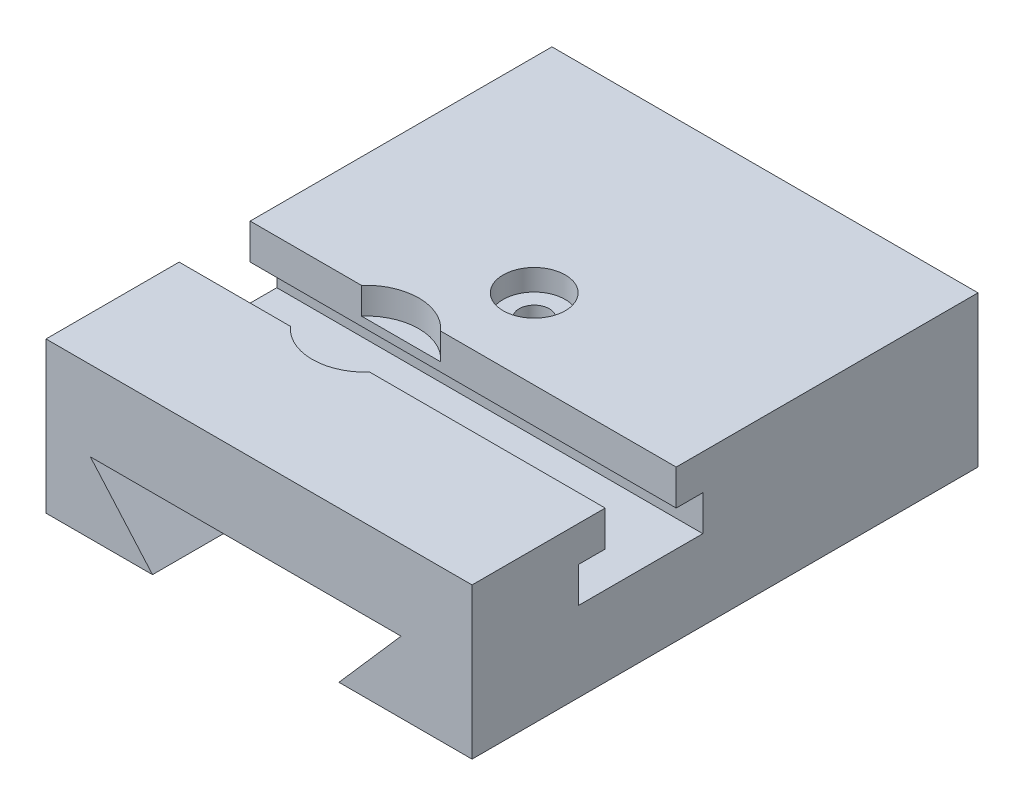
ISO-10303-21;
HEADER;
FILE_DESCRIPTION(('STEP AP214'),'2;1');
FILE_NAME('part.step','',(''),(''),'','','');
FILE_SCHEMA(('AUTOMOTIVE_DESIGN { 1 0 10303 214 1 1 1 1 }'));
ENDSEC;
DATA;
#1=APPLICATION_CONTEXT('core data for automotive mechanical design processes');
#2=APPLICATION_PROTOCOL_DEFINITION('international standard','automotive_design',2000,#1);
#3=PRODUCT_CONTEXT('',#1,'mechanical');
#4=PRODUCT('Part','Part','',(#3));
#5=PRODUCT_RELATED_PRODUCT_CATEGORY('part','',(#4));
#6=PRODUCT_DEFINITION_FORMATION('','',#4);
#7=PRODUCT_DEFINITION_CONTEXT('part definition',#1,'design');
#8=PRODUCT_DEFINITION('design','',#6,#7);
#9=PRODUCT_DEFINITION_SHAPE('','',#8);
#10=(LENGTH_UNIT() NAMED_UNIT(*) SI_UNIT(.MILLI.,.METRE.));
#11=(NAMED_UNIT(*) PLANE_ANGLE_UNIT() SI_UNIT($,.RADIAN.));
#12=(NAMED_UNIT(*) SI_UNIT($,.STERADIAN.) SOLID_ANGLE_UNIT());
#13=UNCERTAINTY_MEASURE_WITH_UNIT(LENGTH_MEASURE(1.E-05),#10,'distance_accuracy_value','');
#14=(GEOMETRIC_REPRESENTATION_CONTEXT(3) GLOBAL_UNCERTAINTY_ASSIGNED_CONTEXT((#13)) GLOBAL_UNIT_ASSIGNED_CONTEXT((#10,
#11,#12)) REPRESENTATION_CONTEXT('',''));
#15=CARTESIAN_POINT('',(0.,0.,0.));
#16=DIRECTION('',(0.,0.,1.));
#17=DIRECTION('',(1.,0.,0.));
#18=AXIS2_PLACEMENT_3D('',#15,#16,#17);
#19=CARTESIAN_POINT('',(0.,0.,0.));
#20=DIRECTION('',(0.,1.,0.));
#21=DIRECTION('',(0.,0.,1.));
#22=AXIS2_PLACEMENT_3D('',#19,#20,#21);
#23=PLANE('',#22);
#24=DIRECTION('',(-1.,0.,0.));
#25=VECTOR('',#24,1.);
#26=CARTESIAN_POINT('',(-24.,0.,-28.5));
#27=LINE('',#26,#25);
#28=CARTESIAN_POINT('',(-12.,0.,-28.5));
#29=VERTEX_POINT('',#28);
#30=CARTESIAN_POINT('',(-24.,0.,-28.5));
#31=VERTEX_POINT('',#30);
#32=EDGE_CURVE('E324',#29,#31,#27,.T.);
#33=ORIENTED_EDGE('',*,*,#32,.F.);
#34=DIRECTION('',(0.,0.,1.));
#35=VECTOR('',#34,1.);
#36=CARTESIAN_POINT('',(-12.,0.,-28.501));
#37=LINE('',#36,#35);
#38=CARTESIAN_POINT('',(-12.,0.,28.5));
#39=VERTEX_POINT('',#38);
#40=EDGE_CURVE('E245',#29,#39,#37,.T.);
#41=ORIENTED_EDGE('',*,*,#40,.T.);
#42=DIRECTION('',(1.,0.,0.));
#43=VECTOR('',#42,1.);
#44=CARTESIAN_POINT('',(-24.,0.,28.5));
#45=LINE('',#44,#43);
#46=CARTESIAN_POINT('',(-24.,0.,28.5));
#47=VERTEX_POINT('',#46);
#48=EDGE_CURVE('E201',#47,#39,#45,.T.);
#49=ORIENTED_EDGE('',*,*,#48,.F.);
#50=DIRECTION('',(0.,0.,1.));
#51=VECTOR('',#50,1.);
#52=CARTESIAN_POINT('',(-24.,0.,-28.5));
#53=LINE('',#52,#51);
#54=EDGE_CURVE('E202',#31,#47,#53,.T.);
#55=ORIENTED_EDGE('',*,*,#54,.F.);
#56=EDGE_LOOP('',(#33,#41,#49,#55));
#57=FACE_BOUND('',#56,.T.);
#58=ADVANCED_FACE('F39',(#57),#23,.F.);
#59=CARTESIAN_POINT('',(0.,17.,0.));
#60=DIRECTION('',(0.,1.,0.));
#61=DIRECTION('',(0.,0.,1.));
#62=AXIS2_PLACEMENT_3D('',#59,#60,#61);
#63=PLANE('',#62);
#64=CARTESIAN_POINT('',(-1.,17.,-3.5));
#65=DIRECTION('',(0.,1.,0.));
#66=DIRECTION('',(0.,0.,1.));
#67=AXIS2_PLACEMENT_3D('',#64,#65,#66);
#68=CIRCLE('',#67,3.5);
#69=CARTESIAN_POINT('',(-1.,17.,0.));
#70=VERTEX_POINT('',#69);
#71=EDGE_CURVE('E643',#70,#70,#68,.T.);
#72=ORIENTED_EDGE('',*,*,#71,.F.);
#73=EDGE_LOOP('',(#72));
#74=FACE_BOUND('',#73,.T.);
#75=CARTESIAN_POINT('',(-7.,17.,9.5));
#76=DIRECTION('',(0.,1.,0.));
#77=DIRECTION('',(0.,0.,1.));
#78=AXIS2_PLACEMENT_3D('',#75,#76,#77);
#79=CIRCLE('',#78,6.);
#80=CARTESIAN_POINT('',(-2.52786404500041,17.,5.50000000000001));
#81=VERTEX_POINT('',#80);
#82=CARTESIAN_POINT('',(-11.4721359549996,17.,5.50000000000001));
#83=VERTEX_POINT('',#82);
#84=EDGE_CURVE('E243',#81,#83,#79,.T.);
#85=ORIENTED_EDGE('',*,*,#84,.F.);
#86=DIRECTION('',(1.,0.,0.));
#87=VECTOR('',#86,1.);
#88=CARTESIAN_POINT('',(-24.001,17.,5.50000000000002));
#89=LINE('',#88,#87);
#90=CARTESIAN_POINT('',(24.,17.,5.5));
#91=VERTEX_POINT('',#90);
#92=EDGE_CURVE('E300',#81,#91,#89,.T.);
#93=ORIENTED_EDGE('',*,*,#92,.T.);
#94=DIRECTION('',(0.,0.,-1.));
#95=VECTOR('',#94,1.);
#96=CARTESIAN_POINT('',(24.,17.,-28.5));
#97=LINE('',#96,#95);
#98=CARTESIAN_POINT('',(24.,17.,-28.5));
#99=VERTEX_POINT('',#98);
#100=EDGE_CURVE('E204',#91,#99,#97,.T.);
#101=ORIENTED_EDGE('',*,*,#100,.T.);
#102=DIRECTION('',(-1.,0.,0.));
#103=VECTOR('',#102,1.);
#104=CARTESIAN_POINT('',(-24.,17.,-28.5));
#105=LINE('',#104,#103);
#106=CARTESIAN_POINT('',(-24.,17.,-28.5));
#107=VERTEX_POINT('',#106);
#108=EDGE_CURVE('E317',#99,#107,#105,.T.);
#109=ORIENTED_EDGE('',*,*,#108,.T.);
#110=DIRECTION('',(0.,0.,1.));
#111=VECTOR('',#110,1.);
#112=CARTESIAN_POINT('',(-24.,17.,-28.5));
#113=LINE('',#112,#111);
#114=CARTESIAN_POINT('',(-24.,17.,5.50000000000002));
#115=VERTEX_POINT('',#114);
#116=EDGE_CURVE('E320',#107,#115,#113,.T.);
#117=ORIENTED_EDGE('',*,*,#116,.T.);
#118=EDGE_CURVE('E296',#115,#83,#89,.T.);
#119=ORIENTED_EDGE('',*,*,#118,.T.);
#120=EDGE_LOOP('',(#85,#93,#101,#109,#117,#119));
#121=FACE_BOUND('',#120,.T.);
#122=ADVANCED_FACE('F374',(#74,#121),#63,.T.);
#123=CARTESIAN_POINT('',(24.,17.,-28.5));
#124=DIRECTION('',(-1.,0.,0.));
#125=DIRECTION('',(0.,0.,1.));
#126=AXIS2_PLACEMENT_3D('',#123,#124,#125);
#127=PLANE('',#126);
#128=ORIENTED_EDGE('',*,*,#100,.F.);
#129=DIRECTION('',(0.,1.,0.));
#130=VECTOR('',#129,1.);
#131=CARTESIAN_POINT('',(24.,13.,5.5));
#132=LINE('',#131,#130);
#133=CARTESIAN_POINT('',(24.,13.,5.5));
#134=VERTEX_POINT('',#133);
#135=EDGE_CURVE('E293',#134,#91,#132,.T.);
#136=ORIENTED_EDGE('',*,*,#135,.F.);
#137=DIRECTION('',(0.,0.,1.));
#138=VECTOR('',#137,1.);
#139=CARTESIAN_POINT('',(24.,13.,2.5));
#140=LINE('',#139,#138);
#141=CARTESIAN_POINT('',(24.,13.,2.5));
#142=VERTEX_POINT('',#141);
#143=EDGE_CURVE('E290',#142,#134,#140,.T.);
#144=ORIENTED_EDGE('',*,*,#143,.F.);
#145=DIRECTION('',(0.,1.,0.));
#146=VECTOR('',#145,1.);
#147=CARTESIAN_POINT('',(24.,9.,2.5));
#148=LINE('',#147,#146);
#149=CARTESIAN_POINT('',(24.,9.,2.5));
#150=VERTEX_POINT('',#149);
#151=EDGE_CURVE('E287',#150,#142,#148,.T.);
#152=ORIENTED_EDGE('',*,*,#151,.F.);
#153=DIRECTION('',(0.,0.,-1.));
#154=VECTOR('',#153,1.);
#155=CARTESIAN_POINT('',(24.,9.,16.5));
#156=LINE('',#155,#154);
#157=CARTESIAN_POINT('',(24.,9.,16.5));
#158=VERTEX_POINT('',#157);
#159=EDGE_CURVE('E284',#158,#150,#156,.T.);
#160=ORIENTED_EDGE('',*,*,#159,.F.);
#161=DIRECTION('',(0.,-1.,0.));
#162=VECTOR('',#161,1.);
#163=CARTESIAN_POINT('',(24.,13.,16.5));
#164=LINE('',#163,#162);
#165=CARTESIAN_POINT('',(24.,13.,16.5));
#166=VERTEX_POINT('',#165);
#167=EDGE_CURVE('E281',#166,#158,#164,.T.);
#168=ORIENTED_EDGE('',*,*,#167,.F.);
#169=DIRECTION('',(0.,0.,1.));
#170=VECTOR('',#169,1.);
#171=CARTESIAN_POINT('',(24.,13.,13.5));
#172=LINE('',#171,#170);
#173=CARTESIAN_POINT('',(24.,13.,13.5));
#174=VERTEX_POINT('',#173);
#175=EDGE_CURVE('E278',#174,#166,#172,.T.);
#176=ORIENTED_EDGE('',*,*,#175,.F.);
#177=DIRECTION('',(0.,-1.,0.));
#178=VECTOR('',#177,1.);
#179=CARTESIAN_POINT('',(24.,17.,13.5));
#180=LINE('',#179,#178);
#181=CARTESIAN_POINT('',(24.,17.,13.5));
#182=VERTEX_POINT('',#181);
#183=EDGE_CURVE('E275',#182,#174,#180,.T.);
#184=ORIENTED_EDGE('',*,*,#183,.F.);
#185=CARTESIAN_POINT('',(24.,17.,28.5));
#186=VERTEX_POINT('',#185);
#187=EDGE_CURVE('E315',#186,#182,#97,.T.);
#188=ORIENTED_EDGE('',*,*,#187,.F.);
#189=DIRECTION('',(0.,-1.,0.));
#190=VECTOR('',#189,1.);
#191=CARTESIAN_POINT('',(24.,17.,28.5));
#192=LINE('',#191,#190);
#193=CARTESIAN_POINT('',(24.,0.,28.5));
#194=VERTEX_POINT('',#193);
#195=EDGE_CURVE('E209',#186,#194,#192,.T.);
#196=ORIENTED_EDGE('',*,*,#195,.T.);
#197=DIRECTION('',(0.,0.,-1.));
#198=VECTOR('',#197,1.);
#199=CARTESIAN_POINT('',(24.,0.,-28.5));
#200=LINE('',#199,#198);
#201=CARTESIAN_POINT('',(24.,0.,-28.5));
#202=VERTEX_POINT('',#201);
#203=EDGE_CURVE('E200',#194,#202,#200,.T.);
#204=ORIENTED_EDGE('',*,*,#203,.T.);
#205=DIRECTION('',(0.,-1.,0.));
#206=VECTOR('',#205,1.);
#207=CARTESIAN_POINT('',(24.,17.,-28.5));
#208=LINE('',#207,#206);
#209=EDGE_CURVE('E218',#99,#202,#208,.T.);
#210=ORIENTED_EDGE('',*,*,#209,.F.);
#211=EDGE_LOOP('',(#128,#136,#144,#152,#160,#168,#176,#184,#188,#196,#204,#210));
#212=FACE_BOUND('',#211,.T.);
#213=ADVANCED_FACE('F41',(#212),#127,.F.);
#214=CARTESIAN_POINT('',(-24.,17.,-28.5));
#215=DIRECTION('',(0.,0.,1.));
#216=DIRECTION('',(1.,0.,0.));
#217=AXIS2_PLACEMENT_3D('',#214,#215,#216);
#218=PLANE('',#217);
#219=DIRECTION('',(1.,0.,0.));
#220=VECTOR('',#219,1.);
#221=CARTESIAN_POINT('',(16.,8.,-28.5));
#222=LINE('',#221,#220);
#223=CARTESIAN_POINT('',(-19.,8.,-28.5));
#224=VERTEX_POINT('',#223);
#225=CARTESIAN_POINT('',(16.,8.,-28.5));
#226=VERTEX_POINT('',#225);
#227=EDGE_CURVE('E650',#224,#226,#222,.T.);
#228=ORIENTED_EDGE('',*,*,#227,.F.);
#229=DIRECTION('',(-0.658504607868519,0.752576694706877,0.));
#230=VECTOR('',#229,1.);
#231=CARTESIAN_POINT('',(-19.,8.,-28.5));
#232=LINE('',#231,#230);
#233=EDGE_CURVE('E195',#29,#224,#232,.T.);
#234=ORIENTED_EDGE('',*,*,#233,.F.);
#235=ORIENTED_EDGE('',*,*,#32,.T.);
#236=DIRECTION('',(0.,-1.,0.));
#237=VECTOR('',#236,1.);
#238=CARTESIAN_POINT('',(-24.,17.,-28.5));
#239=LINE('',#238,#237);
#240=EDGE_CURVE('E215',#107,#31,#239,.T.);
#241=ORIENTED_EDGE('',*,*,#240,.F.);
#242=ORIENTED_EDGE('',*,*,#108,.F.);
#243=ORIENTED_EDGE('',*,*,#209,.T.);
#244=CARTESIAN_POINT('',(9.,0.,-28.5));
#245=VERTEX_POINT('',#244);
#246=EDGE_CURVE('E205',#202,#245,#27,.T.);
#247=ORIENTED_EDGE('',*,*,#246,.T.);
#248=DIRECTION('',(-0.658504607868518,-0.752576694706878,0.));
#249=VECTOR('',#248,1.);
#250=CARTESIAN_POINT('',(9.00000000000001,0.,-28.5));
#251=LINE('',#250,#249);
#252=EDGE_CURVE('E55',#226,#245,#251,.T.);
#253=ORIENTED_EDGE('',*,*,#252,.F.);
#254=EDGE_LOOP('',(#228,#234,#235,#241,#242,#243,#247,#253));
#255=FACE_BOUND('',#254,.T.);
#256=ADVANCED_FACE('F330',(#255),#218,.F.);
#257=CARTESIAN_POINT('',(-24.,17.,-28.5));
#258=DIRECTION('',(1.,0.,0.));
#259=DIRECTION('',(0.,0.,-1.));
#260=AXIS2_PLACEMENT_3D('',#257,#258,#259);
#261=PLANE('',#260);
#262=DIRECTION('',(0.,0.,-1.));
#263=VECTOR('',#262,1.);
#264=CARTESIAN_POINT('',(-24.,13.,2.50000000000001));
#265=LINE('',#264,#263);
#266=CARTESIAN_POINT('',(-24.,13.,5.50000000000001));
#267=VERTEX_POINT('',#266);
#268=CARTESIAN_POINT('',(-24.,13.,2.50000000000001));
#269=VERTEX_POINT('',#268);
#270=EDGE_CURVE('E269',#267,#269,#265,.T.);
#271=ORIENTED_EDGE('',*,*,#270,.F.);
#272=DIRECTION('',(0.,-1.,0.));
#273=VECTOR('',#272,1.);
#274=CARTESIAN_POINT('',(-24.,13.,5.50000000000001));
#275=LINE('',#274,#273);
#276=EDGE_CURVE('E272',#115,#267,#275,.T.);
#277=ORIENTED_EDGE('',*,*,#276,.F.);
#278=ORIENTED_EDGE('',*,*,#116,.F.);
#279=ORIENTED_EDGE('',*,*,#240,.T.);
#280=ORIENTED_EDGE('',*,*,#54,.T.);
#281=DIRECTION('',(0.,-1.,0.));
#282=VECTOR('',#281,1.);
#283=CARTESIAN_POINT('',(-24.,17.,28.5));
#284=LINE('',#283,#282);
#285=CARTESIAN_POINT('',(-24.,17.,28.5));
#286=VERTEX_POINT('',#285);
#287=EDGE_CURVE('E211',#286,#47,#284,.T.);
#288=ORIENTED_EDGE('',*,*,#287,.F.);
#289=CARTESIAN_POINT('',(-24.,17.,13.5));
#290=VERTEX_POINT('',#289);
#291=EDGE_CURVE('E319',#290,#286,#113,.T.);
#292=ORIENTED_EDGE('',*,*,#291,.F.);
#293=DIRECTION('',(0.,1.,0.));
#294=VECTOR('',#293,1.);
#295=CARTESIAN_POINT('',(-24.,17.,13.5));
#296=LINE('',#295,#294);
#297=CARTESIAN_POINT('',(-24.,13.,13.5));
#298=VERTEX_POINT('',#297);
#299=EDGE_CURVE('E299',#298,#290,#296,.T.);
#300=ORIENTED_EDGE('',*,*,#299,.F.);
#301=DIRECTION('',(0.,0.,-1.));
#302=VECTOR('',#301,1.);
#303=CARTESIAN_POINT('',(-24.,13.,13.5));
#304=LINE('',#303,#302);
#305=CARTESIAN_POINT('',(-24.,13.,16.5));
#306=VERTEX_POINT('',#305);
#307=EDGE_CURVE('E257',#306,#298,#304,.T.);
#308=ORIENTED_EDGE('',*,*,#307,.F.);
#309=DIRECTION('',(0.,1.,0.));
#310=VECTOR('',#309,1.);
#311=CARTESIAN_POINT('',(-24.,13.,16.5));
#312=LINE('',#311,#310);
#313=CARTESIAN_POINT('',(-24.,9.,16.5));
#314=VERTEX_POINT('',#313);
#315=EDGE_CURVE('E260',#314,#306,#312,.T.);
#316=ORIENTED_EDGE('',*,*,#315,.F.);
#317=DIRECTION('',(0.,0.,1.));
#318=VECTOR('',#317,1.);
#319=CARTESIAN_POINT('',(-24.,9.,16.5));
#320=LINE('',#319,#318);
#321=CARTESIAN_POINT('',(-24.,9.,2.50000000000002));
#322=VERTEX_POINT('',#321);
#323=EDGE_CURVE('E263',#322,#314,#320,.T.);
#324=ORIENTED_EDGE('',*,*,#323,.F.);
#325=DIRECTION('',(0.,-1.,0.));
#326=VECTOR('',#325,1.);
#327=CARTESIAN_POINT('',(-24.,9.,2.50000000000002));
#328=LINE('',#327,#326);
#329=EDGE_CURVE('E266',#269,#322,#328,.T.);
#330=ORIENTED_EDGE('',*,*,#329,.F.);
#331=EDGE_LOOP('',(#271,#277,#278,#279,#280,#288,#292,#300,#308,#316,#324,#330));
#332=FACE_BOUND('',#331,.T.);
#333=ADVANCED_FACE('F339',(#332),#261,.F.);
#334=CARTESIAN_POINT('',(-24.,17.,28.5));
#335=DIRECTION('',(0.,0.,-1.));
#336=DIRECTION('',(-1.,0.,0.));
#337=AXIS2_PLACEMENT_3D('',#334,#335,#336);
#338=PLANE('',#337);
#339=ORIENTED_EDGE('',*,*,#48,.T.);
#340=DIRECTION('',(0.658504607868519,-0.752576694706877,0.));
#341=VECTOR('',#340,1.);
#342=CARTESIAN_POINT('',(-19.,8.,28.5));
#343=LINE('',#342,#341);
#344=CARTESIAN_POINT('',(-19.,8.,28.5));
#345=VERTEX_POINT('',#344);
#346=EDGE_CURVE('E184',#345,#39,#343,.T.);
#347=ORIENTED_EDGE('',*,*,#346,.F.);
#348=DIRECTION('',(-1.,0.,0.));
#349=VECTOR('',#348,1.);
#350=CARTESIAN_POINT('',(16.,8.,28.5));
#351=LINE('',#350,#349);
#352=CARTESIAN_POINT('',(16.,8.,28.5));
#353=VERTEX_POINT('',#352);
#354=EDGE_CURVE('E194',#353,#345,#351,.T.);
#355=ORIENTED_EDGE('',*,*,#354,.F.);
#356=DIRECTION('',(0.658504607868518,0.752576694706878,0.));
#357=VECTOR('',#356,1.);
#358=CARTESIAN_POINT('',(9.00000000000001,0.,28.5));
#359=LINE('',#358,#357);
#360=CARTESIAN_POINT('',(9.00000000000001,0.,28.5));
#361=VERTEX_POINT('',#360);
#362=EDGE_CURVE('E178',#361,#353,#359,.T.);
#363=ORIENTED_EDGE('',*,*,#362,.F.);
#364=EDGE_CURVE('E190',#361,#194,#45,.T.);
#365=ORIENTED_EDGE('',*,*,#364,.T.);
#366=ORIENTED_EDGE('',*,*,#195,.F.);
#367=DIRECTION('',(1.,0.,0.));
#368=VECTOR('',#367,1.);
#369=CARTESIAN_POINT('',(-24.,17.,28.5));
#370=LINE('',#369,#368);
#371=EDGE_CURVE('E212',#286,#186,#370,.T.);
#372=ORIENTED_EDGE('',*,*,#371,.F.);
#373=ORIENTED_EDGE('',*,*,#287,.T.);
#374=EDGE_LOOP('',(#339,#347,#355,#363,#365,#366,#372,#373));
#375=FACE_BOUND('',#374,.T.);
#376=ADVANCED_FACE('F188',(#375),#338,.F.);
#377=CARTESIAN_POINT('',(-11.4721359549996,17.,13.5));
#378=VERTEX_POINT('',#377);
#379=CARTESIAN_POINT('',(-2.52786404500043,17.,13.5));
#380=VERTEX_POINT('',#379);
#381=EDGE_CURVE('E235',#378,#380,#79,.T.);
#382=ORIENTED_EDGE('',*,*,#381,.F.);
#383=DIRECTION('',(1.,0.,0.));
#384=VECTOR('',#383,1.);
#385=CARTESIAN_POINT('',(-24.001,17.,13.5));
#386=LINE('',#385,#384);
#387=EDGE_CURVE('E229',#290,#378,#386,.T.);
#388=ORIENTED_EDGE('',*,*,#387,.F.);
#389=ORIENTED_EDGE('',*,*,#291,.T.);
#390=ORIENTED_EDGE('',*,*,#371,.T.);
#391=ORIENTED_EDGE('',*,*,#187,.T.);
#392=EDGE_CURVE('E242',#380,#182,#386,.T.);
#393=ORIENTED_EDGE('',*,*,#392,.F.);
#394=EDGE_LOOP('',(#382,#388,#389,#390,#391,#393));
#395=FACE_BOUND('',#394,.T.);
#396=ADVANCED_FACE('F239',(#395),#63,.T.);
#397=ORIENTED_EDGE('',*,*,#364,.F.);
#398=DIRECTION('',(0.,0.,1.));
#399=VECTOR('',#398,1.);
#400=CARTESIAN_POINT('',(9.00000000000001,0.,-28.501));
#401=LINE('',#400,#399);
#402=EDGE_CURVE('E175',#245,#361,#401,.T.);
#403=ORIENTED_EDGE('',*,*,#402,.F.);
#404=ORIENTED_EDGE('',*,*,#246,.F.);
#405=ORIENTED_EDGE('',*,*,#203,.F.);
#406=EDGE_LOOP('',(#397,#403,#404,#405));
#407=FACE_BOUND('',#406,.T.);
#408=ADVANCED_FACE('F198',(#407),#23,.F.);
#409=CARTESIAN_POINT('',(-24.001,13.,5.50000000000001));
#410=DIRECTION('',(0.,0.,-1.));
#411=DIRECTION('',(-1.,0.,0.));
#412=AXIS2_PLACEMENT_3D('',#409,#410,#411);
#413=PLANE('',#412);
#414=DIRECTION('',(1.,0.,0.));
#415=VECTOR('',#414,1.);
#416=CARTESIAN_POINT('',(-24.001,14.,5.50000000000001));
#417=LINE('',#416,#415);
#418=CARTESIAN_POINT('',(-11.4721359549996,14.,5.50000000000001));
#419=VERTEX_POINT('',#418);
#420=CARTESIAN_POINT('',(-2.52786404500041,14.,5.50000000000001));
#421=VERTEX_POINT('',#420);
#422=EDGE_CURVE('E249',#419,#421,#417,.T.);
#423=ORIENTED_EDGE('',*,*,#422,.F.);
#424=DIRECTION('',(0.,1.,0.));
#425=VECTOR('',#424,1.);
#426=CARTESIAN_POINT('',(-11.4721359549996,14.,5.50000000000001));
#427=LINE('',#426,#425);
#428=EDGE_CURVE('E254',#419,#83,#427,.T.);
#429=ORIENTED_EDGE('',*,*,#428,.T.);
#430=ORIENTED_EDGE('',*,*,#118,.F.);
#431=ORIENTED_EDGE('',*,*,#276,.T.);
#432=DIRECTION('',(1.,0.,0.));
#433=VECTOR('',#432,1.);
#434=CARTESIAN_POINT('',(-24.001,13.,5.50000000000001));
#435=LINE('',#434,#433);
#436=EDGE_CURVE('E301',#267,#134,#435,.T.);
#437=ORIENTED_EDGE('',*,*,#436,.T.);
#438=ORIENTED_EDGE('',*,*,#135,.T.);
#439=ORIENTED_EDGE('',*,*,#92,.F.);
#440=DIRECTION('',(0.,1.,0.));
#441=VECTOR('',#440,1.);
#442=CARTESIAN_POINT('',(-2.52786404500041,14.,5.50000000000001));
#443=LINE('',#442,#441);
#444=EDGE_CURVE('E251',#81,#421,#443,.F.);
#445=ORIENTED_EDGE('',*,*,#444,.T.);
#446=EDGE_LOOP('',(#423,#429,#430,#431,#437,#438,#439,#445));
#447=FACE_BOUND('',#446,.T.);
#448=ADVANCED_FACE('F371',(#447),#413,.F.);
#449=CARTESIAN_POINT('',(-24.001,13.,2.50000000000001));
#450=DIRECTION('',(0.,1.,0.));
#451=DIRECTION('',(0.,0.,1.));
#452=AXIS2_PLACEMENT_3D('',#449,#450,#451);
#453=PLANE('',#452);
#454=ORIENTED_EDGE('',*,*,#270,.T.);
#455=DIRECTION('',(1.,0.,0.));
#456=VECTOR('',#455,1.);
#457=CARTESIAN_POINT('',(-24.001,13.,2.50000000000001));
#458=LINE('',#457,#456);
#459=EDGE_CURVE('E303',#269,#142,#458,.T.);
#460=ORIENTED_EDGE('',*,*,#459,.T.);
#461=ORIENTED_EDGE('',*,*,#143,.T.);
#462=ORIENTED_EDGE('',*,*,#436,.F.);
#463=EDGE_LOOP('',(#454,#460,#461,#462));
#464=FACE_BOUND('',#463,.T.);
#465=ADVANCED_FACE('F366',(#464),#453,.F.);
#466=CARTESIAN_POINT('',(-24.001,9.,2.50000000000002));
#467=DIRECTION('',(0.,0.,-1.));
#468=DIRECTION('',(-1.,0.,0.));
#469=AXIS2_PLACEMENT_3D('',#466,#467,#468);
#470=PLANE('',#469);
#471=ORIENTED_EDGE('',*,*,#329,.T.);
#472=DIRECTION('',(1.,0.,0.));
#473=VECTOR('',#472,1.);
#474=CARTESIAN_POINT('',(-24.001,9.,2.50000000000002));
#475=LINE('',#474,#473);
#476=EDGE_CURVE('E305',#322,#150,#475,.T.);
#477=ORIENTED_EDGE('',*,*,#476,.T.);
#478=ORIENTED_EDGE('',*,*,#151,.T.);
#479=ORIENTED_EDGE('',*,*,#459,.F.);
#480=EDGE_LOOP('',(#471,#477,#478,#479));
#481=FACE_BOUND('',#480,.T.);
#482=ADVANCED_FACE('F364',(#481),#470,.F.);
#483=CARTESIAN_POINT('',(-24.001,9.,16.5));
#484=DIRECTION('',(0.,-1.,0.));
#485=DIRECTION('',(0.,0.,-1.));
#486=AXIS2_PLACEMENT_3D('',#483,#484,#485);
#487=PLANE('',#486);
#488=ORIENTED_EDGE('',*,*,#323,.T.);
#489=DIRECTION('',(1.,0.,0.));
#490=VECTOR('',#489,1.);
#491=CARTESIAN_POINT('',(-24.001,9.,16.5));
#492=LINE('',#491,#490);
#493=EDGE_CURVE('E307',#314,#158,#492,.T.);
#494=ORIENTED_EDGE('',*,*,#493,.T.);
#495=ORIENTED_EDGE('',*,*,#159,.T.);
#496=ORIENTED_EDGE('',*,*,#476,.F.);
#497=EDGE_LOOP('',(#488,#494,#495,#496));
#498=FACE_BOUND('',#497,.T.);
#499=ADVANCED_FACE('F361',(#498),#487,.F.);
#500=CARTESIAN_POINT('',(-24.001,13.,16.5));
#501=DIRECTION('',(0.,0.,1.));
#502=DIRECTION('',(0.,-1.,0.));
#503=AXIS2_PLACEMENT_3D('',#500,#501,#502);
#504=PLANE('',#503);
#505=ORIENTED_EDGE('',*,*,#315,.T.);
#506=DIRECTION('',(1.,0.,0.));
#507=VECTOR('',#506,1.);
#508=CARTESIAN_POINT('',(-24.001,13.,16.5));
#509=LINE('',#508,#507);
#510=EDGE_CURVE('E309',#306,#166,#509,.T.);
#511=ORIENTED_EDGE('',*,*,#510,.T.);
#512=ORIENTED_EDGE('',*,*,#167,.T.);
#513=ORIENTED_EDGE('',*,*,#493,.F.);
#514=EDGE_LOOP('',(#505,#511,#512,#513));
#515=FACE_BOUND('',#514,.T.);
#516=ADVANCED_FACE('F358',(#515),#504,.F.);
#517=CARTESIAN_POINT('',(-24.001,13.,13.5));
#518=DIRECTION('',(0.,1.,0.));
#519=DIRECTION('',(0.,0.,1.));
#520=AXIS2_PLACEMENT_3D('',#517,#518,#519);
#521=PLANE('',#520);
#522=ORIENTED_EDGE('',*,*,#307,.T.);
#523=DIRECTION('',(1.,0.,0.));
#524=VECTOR('',#523,1.);
#525=CARTESIAN_POINT('',(-24.001,13.,13.5));
#526=LINE('',#525,#524);
#527=EDGE_CURVE('E311',#298,#174,#526,.T.);
#528=ORIENTED_EDGE('',*,*,#527,.T.);
#529=ORIENTED_EDGE('',*,*,#175,.T.);
#530=ORIENTED_EDGE('',*,*,#510,.F.);
#531=EDGE_LOOP('',(#522,#528,#529,#530));
#532=FACE_BOUND('',#531,.T.);
#533=ADVANCED_FACE('F353',(#532),#521,.F.);
#534=CARTESIAN_POINT('',(-24.001,17.,13.5));
#535=DIRECTION('',(0.,0.,1.));
#536=DIRECTION('',(0.,-1.,0.));
#537=AXIS2_PLACEMENT_3D('',#534,#535,#536);
#538=PLANE('',#537);
#539=DIRECTION('',(-1.,0.,0.));
#540=VECTOR('',#539,1.);
#541=CARTESIAN_POINT('',(-24.001,14.,13.5));
#542=LINE('',#541,#540);
#543=CARTESIAN_POINT('',(-2.52786404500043,14.,13.5));
#544=VERTEX_POINT('',#543);
#545=CARTESIAN_POINT('',(-11.4721359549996,14.,13.5));
#546=VERTEX_POINT('',#545);
#547=EDGE_CURVE('E221',#544,#546,#542,.T.);
#548=ORIENTED_EDGE('',*,*,#547,.F.);
#549=DIRECTION('',(0.,1.,0.));
#550=VECTOR('',#549,1.);
#551=CARTESIAN_POINT('',(-2.52786404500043,14.,13.5));
#552=LINE('',#551,#550);
#553=EDGE_CURVE('E11',#544,#380,#552,.T.);
#554=ORIENTED_EDGE('',*,*,#553,.T.);
#555=ORIENTED_EDGE('',*,*,#392,.T.);
#556=ORIENTED_EDGE('',*,*,#183,.T.);
#557=ORIENTED_EDGE('',*,*,#527,.F.);
#558=ORIENTED_EDGE('',*,*,#299,.T.);
#559=ORIENTED_EDGE('',*,*,#387,.T.);
#560=DIRECTION('',(0.,1.,0.));
#561=VECTOR('',#560,1.);
#562=CARTESIAN_POINT('',(-11.4721359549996,14.,13.5));
#563=LINE('',#562,#561);
#564=EDGE_CURVE('E48',#378,#546,#563,.F.);
#565=ORIENTED_EDGE('',*,*,#564,.T.);
#566=EDGE_LOOP('',(#548,#554,#555,#556,#557,#558,#559,#565));
#567=FACE_BOUND('',#566,.T.);
#568=ADVANCED_FACE('F227',(#567),#538,.F.);
#569=CARTESIAN_POINT('',(-7.,14.,9.5));
#570=DIRECTION('',(0.,1.,0.));
#571=DIRECTION('',(0.,0.,1.));
#572=AXIS2_PLACEMENT_3D('',#569,#570,#571);
#573=PLANE('',#572);
#574=ORIENTED_EDGE('',*,*,#547,.T.);
#575=CARTESIAN_POINT('',(-7.,14.,9.5));
#576=DIRECTION('',(0.,1.,0.));
#577=DIRECTION('',(0.,0.,1.));
#578=AXIS2_PLACEMENT_3D('',#575,#576,#577);
#579=CIRCLE('',#578,6.);
#580=EDGE_CURVE('E236',#546,#544,#579,.T.);
#581=ORIENTED_EDGE('',*,*,#580,.T.);
#582=EDGE_LOOP('',(#574,#581));
#583=FACE_BOUND('',#582,.T.);
#584=ADVANCED_FACE('F380',(#583),#573,.T.);
#585=CARTESIAN_POINT('',(-7.,14.,9.5));
#586=DIRECTION('',(0.,1.,0.));
#587=DIRECTION('',(0.,0.,1.));
#588=AXIS2_PLACEMENT_3D('',#585,#586,#587);
#589=CYLINDRICAL_SURFACE('',#588,6.);
#590=ORIENTED_EDGE('',*,*,#580,.F.);
#591=ORIENTED_EDGE('',*,*,#564,.F.);
#592=ORIENTED_EDGE('',*,*,#381,.T.);
#593=ORIENTED_EDGE('',*,*,#553,.F.);
#594=EDGE_LOOP('',(#590,#591,#592,#593));
#595=FACE_BOUND('',#594,.T.);
#596=ADVANCED_FACE('F233',(#595),#589,.F.);
#597=EDGE_CURVE('E62',#421,#419,#579,.T.);
#598=ORIENTED_EDGE('',*,*,#597,.F.);
#599=ORIENTED_EDGE('',*,*,#444,.F.);
#600=ORIENTED_EDGE('',*,*,#84,.T.);
#601=ORIENTED_EDGE('',*,*,#428,.F.);
#602=EDGE_LOOP('',(#598,#599,#600,#601));
#603=FACE_BOUND('',#602,.T.);
#604=ADVANCED_FACE('F378',(#603),#589,.F.);
#605=ORIENTED_EDGE('',*,*,#422,.T.);
#606=ORIENTED_EDGE('',*,*,#597,.T.);
#607=EDGE_LOOP('',(#605,#606));
#608=FACE_BOUND('',#607,.T.);
#609=ADVANCED_FACE('F383',(#608),#573,.T.);
#610=CARTESIAN_POINT('',(-19.,8.,-28.501));
#611=DIRECTION('',(-0.752576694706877,-0.658504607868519,0.));
#612=DIRECTION('',(0.658504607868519,-0.752576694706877,0.));
#613=AXIS2_PLACEMENT_3D('',#610,#611,#612);
#614=PLANE('',#613);
#615=ORIENTED_EDGE('',*,*,#233,.T.);
#616=DIRECTION('',(0.,0.,1.));
#617=VECTOR('',#616,1.);
#618=CARTESIAN_POINT('',(-19.,8.,-28.501));
#619=LINE('',#618,#617);
#620=EDGE_CURVE('E657',#224,#345,#619,.T.);
#621=ORIENTED_EDGE('',*,*,#620,.T.);
#622=ORIENTED_EDGE('',*,*,#346,.T.);
#623=ORIENTED_EDGE('',*,*,#40,.F.);
#624=EDGE_LOOP('',(#615,#621,#622,#623));
#625=FACE_BOUND('',#624,.T.);
#626=ADVANCED_FACE('F392',(#625),#614,.F.);
#627=CARTESIAN_POINT('',(16.,8.,-28.501));
#628=DIRECTION('',(0.,1.,0.));
#629=DIRECTION('',(0.,0.,1.));
#630=AXIS2_PLACEMENT_3D('',#627,#628,#629);
#631=PLANE('',#630);
#632=CARTESIAN_POINT('',(-1.,8.,-3.5));
#633=DIRECTION('',(0.,1.,0.));
#634=DIRECTION('',(0.,0.,1.));
#635=AXIS2_PLACEMENT_3D('',#632,#633,#634);
#636=CIRCLE('',#635,1.7);
#637=CARTESIAN_POINT('',(-1.,8.,-1.8));
#638=VERTEX_POINT('',#637);
#639=EDGE_CURVE('E43',#638,#638,#636,.T.);
#640=ORIENTED_EDGE('',*,*,#639,.T.);
#641=EDGE_LOOP('',(#640));
#642=FACE_BOUND('',#641,.T.);
#643=ORIENTED_EDGE('',*,*,#227,.T.);
#644=DIRECTION('',(0.,0.,1.));
#645=VECTOR('',#644,1.);
#646=CARTESIAN_POINT('',(16.,8.,-28.501));
#647=LINE('',#646,#645);
#648=EDGE_CURVE('E183',#226,#353,#647,.T.);
#649=ORIENTED_EDGE('',*,*,#648,.T.);
#650=ORIENTED_EDGE('',*,*,#354,.T.);
#651=ORIENTED_EDGE('',*,*,#620,.F.);
#652=EDGE_LOOP('',(#643,#649,#650,#651));
#653=FACE_BOUND('',#652,.T.);
#654=ADVANCED_FACE('F435',(#642,#653),#631,.F.);
#655=CARTESIAN_POINT('',(9.00000000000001,0.,-28.501));
#656=DIRECTION('',(0.752576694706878,-0.658504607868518,0.));
#657=DIRECTION('',(0.658504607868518,0.752576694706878,0.));
#658=AXIS2_PLACEMENT_3D('',#655,#656,#657);
#659=PLANE('',#658);
#660=ORIENTED_EDGE('',*,*,#252,.T.);
#661=ORIENTED_EDGE('',*,*,#402,.T.);
#662=ORIENTED_EDGE('',*,*,#362,.T.);
#663=ORIENTED_EDGE('',*,*,#648,.F.);
#664=EDGE_LOOP('',(#660,#661,#662,#663));
#665=FACE_BOUND('',#664,.T.);
#666=ADVANCED_FACE('F177',(#665),#659,.F.);
#667=CARTESIAN_POINT('',(-1.,17.,-3.5));
#668=DIRECTION('',(0.,1.,0.));
#669=DIRECTION('',(0.,0.,1.));
#670=AXIS2_PLACEMENT_3D('',#667,#668,#669);
#671=CYLINDRICAL_SURFACE('',#670,1.7);
#672=CARTESIAN_POINT('',(-1.,14.6,-3.5));
#673=DIRECTION('',(0.,1.,0.));
#674=DIRECTION('',(0.,0.,1.));
#675=AXIS2_PLACEMENT_3D('',#672,#673,#674);
#676=CIRCLE('',#675,1.7);
#677=CARTESIAN_POINT('',(-1.,14.6,-1.8));
#678=VERTEX_POINT('',#677);
#679=EDGE_CURVE('E645',#678,#678,#676,.T.);
#680=ORIENTED_EDGE('',*,*,#679,.T.);
#681=EDGE_LOOP('',(#680));
#682=FACE_BOUND('',#681,.T.);
#683=ORIENTED_EDGE('',*,*,#639,.F.);
#684=EDGE_LOOP('',(#683));
#685=FACE_BOUND('',#684,.T.);
#686=ADVANCED_FACE('F452',(#682,#685),#671,.F.);
#687=CARTESIAN_POINT('',(0.7,14.6,-3.5));
#688=DIRECTION('',(0.,-1.,0.));
#689=DIRECTION('',(0.,0.,-1.));
#690=AXIS2_PLACEMENT_3D('',#687,#688,#689);
#691=PLANE('',#690);
#692=ORIENTED_EDGE('',*,*,#679,.F.);
#693=EDGE_LOOP('',(#692));
#694=FACE_BOUND('',#693,.T.);
#695=CARTESIAN_POINT('',(-1.,14.6,-3.5));
#696=DIRECTION('',(0.,1.,0.));
#697=DIRECTION('',(0.,0.,1.));
#698=AXIS2_PLACEMENT_3D('',#695,#696,#697);
#699=CIRCLE('',#698,3.5);
#700=CARTESIAN_POINT('',(-1.,14.6,0.));
#701=VERTEX_POINT('',#700);
#702=EDGE_CURVE('E640',#701,#701,#699,.T.);
#703=ORIENTED_EDGE('',*,*,#702,.T.);
#704=EDGE_LOOP('',(#703));
#705=FACE_BOUND('',#704,.T.);
#706=ADVANCED_FACE('F457',(#694,#705),#691,.F.);
#707=CARTESIAN_POINT('',(-1.,17.,-3.5));
#708=DIRECTION('',(0.,1.,0.));
#709=DIRECTION('',(0.,0.,1.));
#710=AXIS2_PLACEMENT_3D('',#707,#708,#709);
#711=CYLINDRICAL_SURFACE('',#710,3.5);
#712=ORIENTED_EDGE('',*,*,#702,.F.);
#713=EDGE_LOOP('',(#712));
#714=FACE_BOUND('',#713,.T.);
#715=ORIENTED_EDGE('',*,*,#71,.T.);
#716=EDGE_LOOP('',(#715));
#717=FACE_BOUND('',#716,.T.);
#718=ADVANCED_FACE('F465',(#714,#717),#711,.F.);
#719=CLOSED_SHELL('',(#58,#122,#213,#256,#333,#376,#396,#408,#448,#465,#482,#499,#516,#533,#568,
#584,#596,#604,#609,#626,#654,#666,#686,#706,#718));
#720=MANIFOLD_SOLID_BREP('B2',#719);
#721=ADVANCED_BREP_SHAPE_REPRESENTATION('',(#18,#720),#14);
#722=SHAPE_DEFINITION_REPRESENTATION(#9,#721);
ENDSEC;
END-ISO-10303-21;
